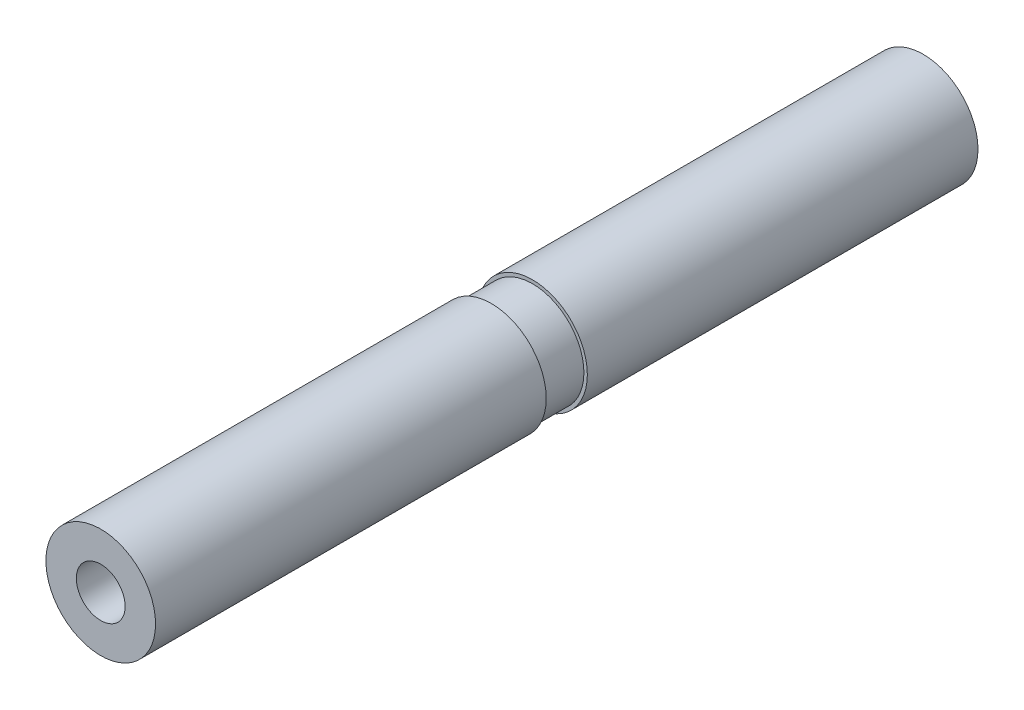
ISO-10303-21;
HEADER;
FILE_DESCRIPTION(('STEP AP214'),'2;1');
FILE_NAME('part.step','',(''),(''),'','','');
FILE_SCHEMA(('AUTOMOTIVE_DESIGN { 1 0 10303 214 1 1 1 1 }'));
ENDSEC;
DATA;
#1=APPLICATION_CONTEXT('core data for automotive mechanical design processes');
#2=APPLICATION_PROTOCOL_DEFINITION('international standard','automotive_design',2000,#1);
#3=PRODUCT_CONTEXT('',#1,'mechanical');
#4=PRODUCT('Part','Part','',(#3));
#5=PRODUCT_RELATED_PRODUCT_CATEGORY('part','',(#4));
#6=PRODUCT_DEFINITION_FORMATION('','',#4);
#7=PRODUCT_DEFINITION_CONTEXT('part definition',#1,'design');
#8=PRODUCT_DEFINITION('design','',#6,#7);
#9=PRODUCT_DEFINITION_SHAPE('','',#8);
#10=(LENGTH_UNIT() NAMED_UNIT(*) SI_UNIT(.MILLI.,.METRE.));
#11=(NAMED_UNIT(*) PLANE_ANGLE_UNIT() SI_UNIT($,.RADIAN.));
#12=(NAMED_UNIT(*) SI_UNIT($,.STERADIAN.) SOLID_ANGLE_UNIT());
#13=UNCERTAINTY_MEASURE_WITH_UNIT(LENGTH_MEASURE(1.E-05),#10,'distance_accuracy_value','');
#14=(GEOMETRIC_REPRESENTATION_CONTEXT(3) GLOBAL_UNCERTAINTY_ASSIGNED_CONTEXT((#13)) GLOBAL_UNIT_ASSIGNED_CONTEXT((#10,
#11,#12)) REPRESENTATION_CONTEXT('',''));
#15=CARTESIAN_POINT('',(0.,0.,0.));
#16=DIRECTION('',(0.,0.,1.));
#17=DIRECTION('',(1.,0.,0.));
#18=AXIS2_PLACEMENT_3D('',#15,#16,#17);
#19=CARTESIAN_POINT('',(8.88178419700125E-13,0.,38.0999999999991));
#20=DIRECTION('',(0.,0.,-1.));
#21=DIRECTION('',(-1.,0.,0.));
#22=AXIS2_PLACEMENT_3D('',#19,#20,#21);
#23=CYLINDRICAL_SURFACE('',#22,2.54);
#24=CARTESIAN_POINT('',(0.,0.,0.));
#25=DIRECTION('',(0.,0.,1.));
#26=DIRECTION('',(1.,0.,0.));
#27=AXIS2_PLACEMENT_3D('',#24,#25,#26);
#28=CIRCLE('',#27,2.54);
#29=CARTESIAN_POINT('',(2.54,0.,0.));
#30=VERTEX_POINT('',#29);
#31=EDGE_CURVE('E40',#30,#30,#28,.T.);
#32=ORIENTED_EDGE('',*,*,#31,.T.);
#33=EDGE_LOOP('',(#32));
#34=FACE_BOUND('',#33,.T.);
#35=CARTESIAN_POINT('',(0.,0.,18.0974999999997));
#36=DIRECTION('',(0.,0.,1.));
#37=DIRECTION('',(1.,0.,0.));
#38=AXIS2_PLACEMENT_3D('',#35,#36,#37);
#39=CIRCLE('',#38,2.54);
#40=CARTESIAN_POINT('',(2.54,0.,18.0974999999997));
#41=VERTEX_POINT('',#40);
#42=EDGE_CURVE('E60',#41,#41,#39,.T.);
#43=ORIENTED_EDGE('',*,*,#42,.F.);
#44=EDGE_LOOP('',(#43));
#45=FACE_BOUND('',#44,.T.);
#46=ADVANCED_FACE('F36',(#34,#45),#23,.T.);
#47=CARTESIAN_POINT('',(2.66453525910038E-12,1.11022302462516E-13,20.0025000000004));
#48=DIRECTION('',(0.,0.,1.));
#49=DIRECTION('',(1.,0.,0.));
#50=AXIS2_PLACEMENT_3D('',#47,#48,#49);
#51=CIRCLE('',#50,2.54);
#52=CARTESIAN_POINT('',(2.54000000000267,1.11122725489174E-13,20.0025000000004));
#53=VERTEX_POINT('',#52);
#54=EDGE_CURVE('E54',#53,#53,#51,.T.);
#55=ORIENTED_EDGE('',*,*,#54,.T.);
#56=EDGE_LOOP('',(#55));
#57=FACE_BOUND('',#56,.T.);
#58=CARTESIAN_POINT('',(8.88178419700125E-13,0.,38.0999999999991));
#59=DIRECTION('',(0.,0.,1.));
#60=DIRECTION('',(1.,0.,0.));
#61=AXIS2_PLACEMENT_3D('',#58,#59,#60);
#62=CIRCLE('',#61,2.54);
#63=CARTESIAN_POINT('',(2.54000000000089,0.,38.0999999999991));
#64=VERTEX_POINT('',#63);
#65=EDGE_CURVE('E10',#64,#64,#62,.T.);
#66=ORIENTED_EDGE('',*,*,#65,.F.);
#67=EDGE_LOOP('',(#66));
#68=FACE_BOUND('',#67,.T.);
#69=ADVANCED_FACE('F38',(#57,#68),#23,.T.);
#70=CARTESIAN_POINT('',(8.88178419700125E-13,0.,38.0999999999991));
#71=DIRECTION('',(0.,0.,1.));
#72=DIRECTION('',(1.,0.,0.));
#73=AXIS2_PLACEMENT_3D('',#70,#71,#72);
#74=PLANE('',#73);
#75=CARTESIAN_POINT('',(8.88178419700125E-13,0.,38.0999999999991));
#76=DIRECTION('',(0.,0.,1.));
#77=DIRECTION('',(1.,0.,0.));
#78=AXIS2_PLACEMENT_3D('',#75,#76,#77);
#79=CIRCLE('',#78,1.1303);
#80=CARTESIAN_POINT('',(1.13030000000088,0.,38.0999999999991));
#81=VERTEX_POINT('',#80);
#82=EDGE_CURVE('E51',#81,#81,#79,.T.);
#83=ORIENTED_EDGE('',*,*,#82,.F.);
#84=EDGE_LOOP('',(#83));
#85=FACE_BOUND('',#84,.T.);
#86=ORIENTED_EDGE('',*,*,#65,.T.);
#87=EDGE_LOOP('',(#86));
#88=FACE_BOUND('',#87,.T.);
#89=ADVANCED_FACE('F80',(#85,#88),#74,.T.);
#90=CARTESIAN_POINT('',(0.,0.,0.));
#91=DIRECTION('',(0.,0.,1.));
#92=DIRECTION('',(1.,0.,0.));
#93=AXIS2_PLACEMENT_3D('',#90,#91,#92);
#94=PLANE('',#93);
#95=CARTESIAN_POINT('',(0.,0.,0.));
#96=DIRECTION('',(0.,0.,1.));
#97=DIRECTION('',(1.,0.,0.));
#98=AXIS2_PLACEMENT_3D('',#95,#96,#97);
#99=CIRCLE('',#98,1.13029999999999);
#100=CARTESIAN_POINT('',(1.13029999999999,0.,0.));
#101=VERTEX_POINT('',#100);
#102=EDGE_CURVE('E47',#101,#101,#99,.T.);
#103=ORIENTED_EDGE('',*,*,#102,.T.);
#104=EDGE_LOOP('',(#103));
#105=FACE_BOUND('',#104,.T.);
#106=ORIENTED_EDGE('',*,*,#31,.F.);
#107=EDGE_LOOP('',(#106));
#108=FACE_BOUND('',#107,.T.);
#109=ADVANCED_FACE('F84',(#105,#108),#94,.F.);
#110=CARTESIAN_POINT('',(8.88178419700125E-13,0.,38.0999999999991));
#111=DIRECTION('',(0.,0.,1.));
#112=DIRECTION('',(1.,0.,0.));
#113=AXIS2_PLACEMENT_3D('',#110,#111,#112);
#114=CYLINDRICAL_SURFACE('',#113,1.13029999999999);
#115=ORIENTED_EDGE('',*,*,#102,.F.);
#116=EDGE_LOOP('',(#115));
#117=FACE_BOUND('',#116,.T.);
#118=ORIENTED_EDGE('',*,*,#82,.T.);
#119=EDGE_LOOP('',(#118));
#120=FACE_BOUND('',#119,.T.);
#121=ADVANCED_FACE('F86',(#117,#120),#114,.F.);
#122=CARTESIAN_POINT('',(2.66453525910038E-12,1.11022302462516E-13,20.0025000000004));
#123=DIRECTION('',(0.,0.,1.));
#124=DIRECTION('',(1.,0.,0.));
#125=AXIS2_PLACEMENT_3D('',#122,#123,#124);
#126=PLANE('',#125);
#127=ORIENTED_EDGE('',*,*,#54,.F.);
#128=EDGE_LOOP('',(#127));
#129=FACE_BOUND('',#128,.T.);
#130=CARTESIAN_POINT('',(2.66453525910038E-12,1.11022302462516E-13,20.0025000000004));
#131=DIRECTION('',(0.,0.,1.));
#132=DIRECTION('',(1.,0.,0.));
#133=AXIS2_PLACEMENT_3D('',#130,#131,#132);
#134=CIRCLE('',#133,2.38125);
#135=CARTESIAN_POINT('',(2.38125000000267,1.11116449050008E-13,20.0025000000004));
#136=VERTEX_POINT('',#135);
#137=EDGE_CURVE('E57',#136,#136,#134,.T.);
#138=ORIENTED_EDGE('',*,*,#137,.T.);
#139=EDGE_LOOP('',(#138));
#140=FACE_BOUND('',#139,.T.);
#141=ADVANCED_FACE('F92',(#129,#140),#126,.F.);
#142=CARTESIAN_POINT('',(2.66453525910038E-12,1.11022302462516E-13,20.0025000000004));
#143=DIRECTION('',(0.,0.,-1.));
#144=DIRECTION('',(-1.,0.,0.));
#145=AXIS2_PLACEMENT_3D('',#142,#143,#144);
#146=CYLINDRICAL_SURFACE('',#145,2.38125);
#147=ORIENTED_EDGE('',*,*,#137,.F.);
#148=EDGE_LOOP('',(#147));
#149=FACE_BOUND('',#148,.T.);
#150=CARTESIAN_POINT('',(0.,0.,18.0974999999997));
#151=DIRECTION('',(0.,0.,1.));
#152=DIRECTION('',(1.,0.,0.));
#153=AXIS2_PLACEMENT_3D('',#150,#151,#152);
#154=CIRCLE('',#153,2.38125);
#155=CARTESIAN_POINT('',(2.38125,0.,18.0974999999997));
#156=VERTEX_POINT('',#155);
#157=EDGE_CURVE('E63',#156,#156,#154,.T.);
#158=ORIENTED_EDGE('',*,*,#157,.T.);
#159=EDGE_LOOP('',(#158));
#160=FACE_BOUND('',#159,.T.);
#161=ADVANCED_FACE('F67',(#149,#160),#146,.T.);
#162=CARTESIAN_POINT('',(0.,0.,18.0974999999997));
#163=DIRECTION('',(0.,0.,1.));
#164=DIRECTION('',(1.,0.,0.));
#165=AXIS2_PLACEMENT_3D('',#162,#163,#164);
#166=PLANE('',#165);
#167=ORIENTED_EDGE('',*,*,#157,.F.);
#168=EDGE_LOOP('',(#167));
#169=FACE_BOUND('',#168,.T.);
#170=ORIENTED_EDGE('',*,*,#42,.T.);
#171=EDGE_LOOP('',(#170));
#172=FACE_BOUND('',#171,.T.);
#173=ADVANCED_FACE('F69',(#169,#172),#166,.T.);
#174=CLOSED_SHELL('',(#46,#69,#89,#109,#121,#141,#161,#173));
#175=MANIFOLD_SOLID_BREP('B2',#174);
#176=ADVANCED_BREP_SHAPE_REPRESENTATION('',(#18,#175),#14);
#177=SHAPE_DEFINITION_REPRESENTATION(#9,#176);
ENDSEC;
END-ISO-10303-21;
